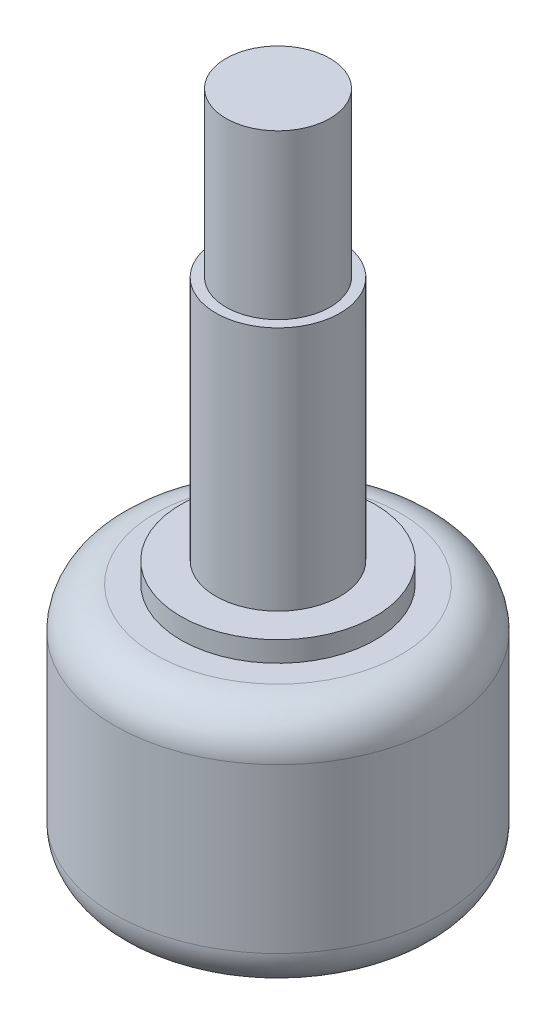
ISO-10303-21;
HEADER;
FILE_DESCRIPTION(('STEP AP214'),'2;1');
FILE_NAME('part.step','',(''),(''),'','','');
FILE_SCHEMA(('AUTOMOTIVE_DESIGN { 1 0 10303 214 1 1 1 1 }'));
ENDSEC;
DATA;
#1=APPLICATION_CONTEXT('core data for automotive mechanical design processes');
#2=APPLICATION_PROTOCOL_DEFINITION('international standard','automotive_design',2000,#1);
#3=PRODUCT_CONTEXT('',#1,'mechanical');
#4=PRODUCT('Part','Part','',(#3));
#5=PRODUCT_RELATED_PRODUCT_CATEGORY('part','',(#4));
#6=PRODUCT_DEFINITION_FORMATION('','',#4);
#7=PRODUCT_DEFINITION_CONTEXT('part definition',#1,'design');
#8=PRODUCT_DEFINITION('design','',#6,#7);
#9=PRODUCT_DEFINITION_SHAPE('','',#8);
#10=(LENGTH_UNIT() NAMED_UNIT(*) SI_UNIT(.MILLI.,.METRE.));
#11=(NAMED_UNIT(*) PLANE_ANGLE_UNIT() SI_UNIT($,.RADIAN.));
#12=(NAMED_UNIT(*) SI_UNIT($,.STERADIAN.) SOLID_ANGLE_UNIT());
#13=UNCERTAINTY_MEASURE_WITH_UNIT(LENGTH_MEASURE(1.E-05),#10,'distance_accuracy_value','');
#14=(GEOMETRIC_REPRESENTATION_CONTEXT(3) GLOBAL_UNCERTAINTY_ASSIGNED_CONTEXT((#13)) GLOBAL_UNIT_ASSIGNED_CONTEXT((#10,
#11,#12)) REPRESENTATION_CONTEXT('',''));
#15=CARTESIAN_POINT('',(0.,0.,0.));
#16=DIRECTION('',(0.,0.,1.));
#17=DIRECTION('',(1.,0.,0.));
#18=AXIS2_PLACEMENT_3D('',#15,#16,#17);
#19=CARTESIAN_POINT('',(-2.0193,26.19375,0.));
#20=DIRECTION('',(0.,1.,0.));
#21=DIRECTION('',(0.,0.,1.));
#22=AXIS2_PLACEMENT_3D('',#19,#20,#21);
#23=PLANE('',#22);
#24=CARTESIAN_POINT('',(0.,26.19375,0.));
#25=DIRECTION('',(0.,-1.,0.));
#26=DIRECTION('',(0.,0.,-1.));
#27=AXIS2_PLACEMENT_3D('',#24,#25,#26);
#28=CIRCLE('',#27,2.0193);
#29=CARTESIAN_POINT('',(0.,26.19375,-2.0193));
#30=VERTEX_POINT('',#29);
#31=EDGE_CURVE('E10',#30,#30,#28,.T.);
#32=ORIENTED_EDGE('',*,*,#31,.F.);
#33=EDGE_LOOP('',(#32));
#34=FACE_BOUND('',#33,.T.);
#35=ADVANCED_FACE('F30',(#34),#23,.T.);
#36=CARTESIAN_POINT('',(0.,0.,0.));
#37=DIRECTION('',(0.,-1.,0.));
#38=DIRECTION('',(0.,0.,-1.));
#39=AXIS2_PLACEMENT_3D('',#36,#37,#38);
#40=CYLINDRICAL_SURFACE('',#39,2.0193);
#41=ORIENTED_EDGE('',*,*,#31,.T.);
#42=EDGE_LOOP('',(#41));
#43=FACE_BOUND('',#42,.T.);
#44=CARTESIAN_POINT('',(0.,19.84375,0.));
#45=DIRECTION('',(0.,-1.,0.));
#46=DIRECTION('',(0.,0.,-1.));
#47=AXIS2_PLACEMENT_3D('',#44,#45,#46);
#48=CIRCLE('',#47,2.0193);
#49=CARTESIAN_POINT('',(0.,19.84375,-2.0193));
#50=VERTEX_POINT('',#49);
#51=EDGE_CURVE('E37',#50,#50,#48,.T.);
#52=ORIENTED_EDGE('',*,*,#51,.F.);
#53=EDGE_LOOP('',(#52));
#54=FACE_BOUND('',#53,.T.);
#55=ADVANCED_FACE('F103',(#43,#54),#40,.T.);
#56=CARTESIAN_POINT('',(-2.413,19.84375,0.));
#57=DIRECTION('',(0.,1.,0.));
#58=DIRECTION('',(0.,0.,1.));
#59=AXIS2_PLACEMENT_3D('',#56,#57,#58);
#60=PLANE('',#59);
#61=ORIENTED_EDGE('',*,*,#51,.T.);
#62=EDGE_LOOP('',(#61));
#63=FACE_BOUND('',#62,.T.);
#64=CARTESIAN_POINT('',(0.,19.84375,0.));
#65=DIRECTION('',(0.,-1.,0.));
#66=DIRECTION('',(0.,0.,-1.));
#67=AXIS2_PLACEMENT_3D('',#64,#65,#66);
#68=CIRCLE('',#67,2.413);
#69=CARTESIAN_POINT('',(0.,19.84375,-2.413));
#70=VERTEX_POINT('',#69);
#71=EDGE_CURVE('E44',#70,#70,#68,.T.);
#72=ORIENTED_EDGE('',*,*,#71,.F.);
#73=EDGE_LOOP('',(#72));
#74=FACE_BOUND('',#73,.T.);
#75=ADVANCED_FACE('F108',(#63,#74),#60,.T.);
#76=CARTESIAN_POINT('',(0.,0.,0.));
#77=DIRECTION('',(0.,-1.,0.));
#78=DIRECTION('',(0.,0.,-1.));
#79=AXIS2_PLACEMENT_3D('',#76,#77,#78);
#80=CYLINDRICAL_SURFACE('',#79,2.413);
#81=ORIENTED_EDGE('',*,*,#71,.T.);
#82=EDGE_LOOP('',(#81));
#83=FACE_BOUND('',#82,.T.);
#84=CARTESIAN_POINT('',(0.,10.31875,0.));
#85=DIRECTION('',(0.,-1.,0.));
#86=DIRECTION('',(0.,0.,-1.));
#87=AXIS2_PLACEMENT_3D('',#84,#85,#86);
#88=CIRCLE('',#87,2.413);
#89=CARTESIAN_POINT('',(0.,10.31875,-2.413));
#90=VERTEX_POINT('',#89);
#91=EDGE_CURVE('E51',#90,#90,#88,.T.);
#92=ORIENTED_EDGE('',*,*,#91,.F.);
#93=EDGE_LOOP('',(#92));
#94=FACE_BOUND('',#93,.T.);
#95=ADVANCED_FACE('F112',(#83,#94),#80,.T.);
#96=CARTESIAN_POINT('',(-3.7703125,10.31875,0.));
#97=DIRECTION('',(0.,1.,0.));
#98=DIRECTION('',(0.,0.,1.));
#99=AXIS2_PLACEMENT_3D('',#96,#97,#98);
#100=PLANE('',#99);
#101=ORIENTED_EDGE('',*,*,#91,.T.);
#102=EDGE_LOOP('',(#101));
#103=FACE_BOUND('',#102,.T.);
#104=CARTESIAN_POINT('',(0.,10.31875,0.));
#105=DIRECTION('',(0.,-1.,0.));
#106=DIRECTION('',(0.,0.,-1.));
#107=AXIS2_PLACEMENT_3D('',#104,#105,#106);
#108=CIRCLE('',#107,3.7703125);
#109=CARTESIAN_POINT('',(0.,10.31875,-3.7703125));
#110=VERTEX_POINT('',#109);
#111=EDGE_CURVE('E57',#110,#110,#108,.T.);
#112=ORIENTED_EDGE('',*,*,#111,.F.);
#113=EDGE_LOOP('',(#112));
#114=FACE_BOUND('',#113,.T.);
#115=ADVANCED_FACE('F118',(#103,#114),#100,.T.);
#116=CARTESIAN_POINT('',(0.,0.,0.));
#117=DIRECTION('',(0.,-1.,0.));
#118=DIRECTION('',(0.,0.,-1.));
#119=AXIS2_PLACEMENT_3D('',#116,#117,#118);
#120=CYLINDRICAL_SURFACE('',#119,3.7703125);
#121=ORIENTED_EDGE('',*,*,#111,.T.);
#122=EDGE_LOOP('',(#121));
#123=FACE_BOUND('',#122,.T.);
#124=CARTESIAN_POINT('',(0.,9.525,0.));
#125=DIRECTION('',(0.,-1.,0.));
#126=DIRECTION('',(0.,0.,-1.));
#127=AXIS2_PLACEMENT_3D('',#124,#125,#126);
#128=CIRCLE('',#127,3.7703125);
#129=CARTESIAN_POINT('',(0.,9.525,-3.7703125));
#130=VERTEX_POINT('',#129);
#131=EDGE_CURVE('E61',#130,#130,#128,.T.);
#132=ORIENTED_EDGE('',*,*,#131,.F.);
#133=EDGE_LOOP('',(#132));
#134=FACE_BOUND('',#133,.T.);
#135=ADVANCED_FACE('F122',(#123,#134),#120,.T.);
#136=CARTESIAN_POINT('',(-4.7625,9.525,0.));
#137=DIRECTION('',(0.,1.,0.));
#138=DIRECTION('',(0.,0.,1.));
#139=AXIS2_PLACEMENT_3D('',#136,#137,#138);
#140=PLANE('',#139);
#141=ORIENTED_EDGE('',*,*,#131,.T.);
#142=EDGE_LOOP('',(#141));
#143=FACE_BOUND('',#142,.T.);
#144=CARTESIAN_POINT('',(0.,9.525,0.));
#145=DIRECTION('',(0.,-1.,0.));
#146=DIRECTION('',(0.,0.,-1.));
#147=AXIS2_PLACEMENT_3D('',#144,#145,#146);
#148=CIRCLE('',#147,4.7625);
#149=CARTESIAN_POINT('',(0.,9.525,-4.7625));
#150=VERTEX_POINT('',#149);
#151=EDGE_CURVE('E64',#150,#150,#148,.T.);
#152=ORIENTED_EDGE('',*,*,#151,.F.);
#153=EDGE_LOOP('',(#152));
#154=FACE_BOUND('',#153,.T.);
#155=ADVANCED_FACE('F99',(#143,#154),#140,.T.);
#156=CARTESIAN_POINT('',(0.,7.9375,0.));
#157=DIRECTION('',(0.,-1.,0.));
#158=DIRECTION('',(0.,0.,-1.));
#159=AXIS2_PLACEMENT_3D('',#156,#157,#158);
#160=TOROIDAL_SURFACE('',#159,4.7625,1.5875);
#161=CARTESIAN_POINT('',(0.,7.9375,0.));
#162=DIRECTION('',(0.,-1.,0.));
#163=DIRECTION('',(0.,0.,-1.));
#164=AXIS2_PLACEMENT_3D('',#161,#162,#163);
#165=CIRCLE('',#164,6.35);
#166=CARTESIAN_POINT('',(0.,7.9375,-6.35));
#167=VERTEX_POINT('',#166);
#168=EDGE_CURVE('E68',#167,#167,#165,.T.);
#169=ORIENTED_EDGE('',*,*,#168,.F.);
#170=EDGE_LOOP('',(#169));
#171=FACE_BOUND('',#170,.T.);
#172=ORIENTED_EDGE('',*,*,#151,.T.);
#173=EDGE_LOOP('',(#172));
#174=FACE_BOUND('',#173,.T.);
#175=ADVANCED_FACE('F93',(#171,#174),#160,.T.);
#176=CARTESIAN_POINT('',(0.,0.,0.));
#177=DIRECTION('',(0.,-1.,0.));
#178=DIRECTION('',(0.,0.,-1.));
#179=AXIS2_PLACEMENT_3D('',#176,#177,#178);
#180=CYLINDRICAL_SURFACE('',#179,6.35);
#181=ORIENTED_EDGE('',*,*,#168,.T.);
#182=EDGE_LOOP('',(#181));
#183=FACE_BOUND('',#182,.T.);
#184=CARTESIAN_POINT('',(0.,1.5875,0.));
#185=DIRECTION('',(0.,-1.,0.));
#186=DIRECTION('',(0.,0.,-1.));
#187=AXIS2_PLACEMENT_3D('',#184,#185,#186);
#188=CIRCLE('',#187,6.35);
#189=CARTESIAN_POINT('',(0.,1.5875,-6.35));
#190=VERTEX_POINT('',#189);
#191=EDGE_CURVE('E72',#190,#190,#188,.T.);
#192=ORIENTED_EDGE('',*,*,#191,.F.);
#193=EDGE_LOOP('',(#192));
#194=FACE_BOUND('',#193,.T.);
#195=ADVANCED_FACE('F88',(#183,#194),#180,.T.);
#196=CARTESIAN_POINT('',(0.,1.5875,0.));
#197=DIRECTION('',(0.,-1.,0.));
#198=DIRECTION('',(0.,0.,-1.));
#199=AXIS2_PLACEMENT_3D('',#196,#197,#198);
#200=TOROIDAL_SURFACE('',#199,4.7625,1.5875);
#201=CARTESIAN_POINT('',(0.,0.,0.));
#202=DIRECTION('',(0.,-1.,0.));
#203=DIRECTION('',(0.,0.,-1.));
#204=AXIS2_PLACEMENT_3D('',#201,#202,#203);
#205=CIRCLE('',#204,4.7625);
#206=CARTESIAN_POINT('',(0.,0.,-4.7625));
#207=VERTEX_POINT('',#206);
#208=EDGE_CURVE('E76',#207,#207,#205,.T.);
#209=ORIENTED_EDGE('',*,*,#208,.F.);
#210=EDGE_LOOP('',(#209));
#211=FACE_BOUND('',#210,.T.);
#212=ORIENTED_EDGE('',*,*,#191,.T.);
#213=EDGE_LOOP('',(#212));
#214=FACE_BOUND('',#213,.T.);
#215=ADVANCED_FACE('F85',(#211,#214),#200,.T.);
#216=CARTESIAN_POINT('',(0.,0.,0.));
#217=DIRECTION('',(0.,-1.,0.));
#218=DIRECTION('',(0.,0.,-1.));
#219=AXIS2_PLACEMENT_3D('',#216,#217,#218);
#220=PLANE('',#219);
#221=ORIENTED_EDGE('',*,*,#208,.T.);
#222=EDGE_LOOP('',(#221));
#223=FACE_BOUND('',#222,.T.);
#224=ADVANCED_FACE('F83',(#223),#220,.T.);
#225=CLOSED_SHELL('',(#35,#55,#75,#95,#115,#135,#155,#175,#195,#215,#224));
#226=MANIFOLD_SOLID_BREP('B2',#225);
#227=ADVANCED_BREP_SHAPE_REPRESENTATION('',(#18,#226),#14);
#228=SHAPE_DEFINITION_REPRESENTATION(#9,#227);
ENDSEC;
END-ISO-10303-21;
